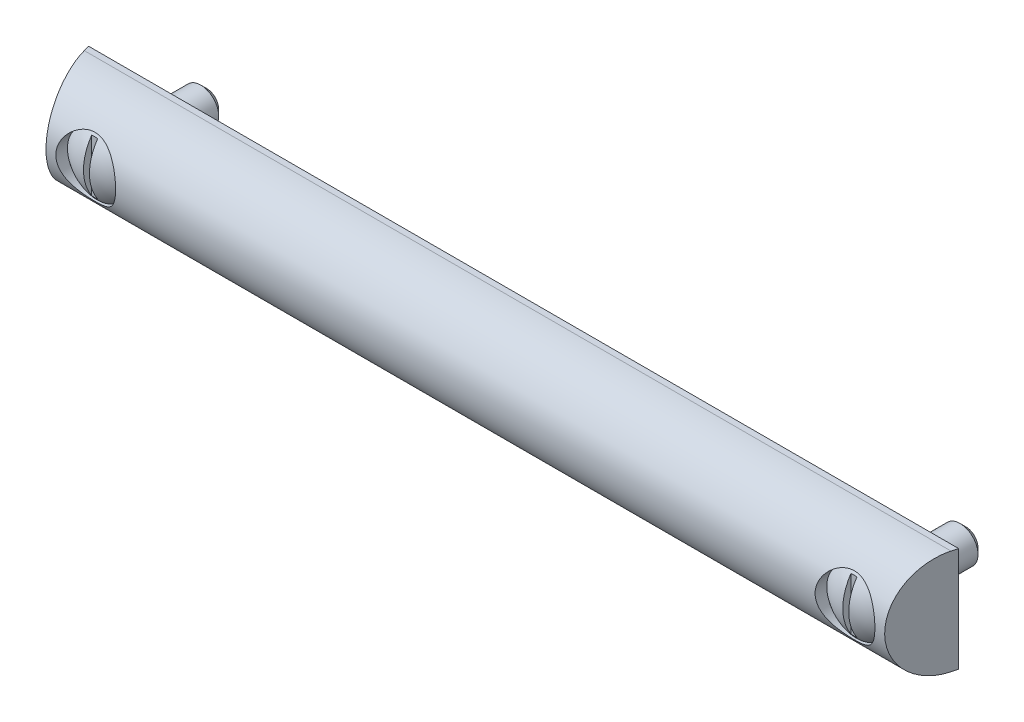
ISO-10303-21;
HEADER;
FILE_DESCRIPTION(('STEP AP214'),'2;1');
FILE_NAME('part.step','',(''),(''),'','','');
FILE_SCHEMA(('AUTOMOTIVE_DESIGN { 1 0 10303 214 1 1 1 1 }'));
ENDSEC;
DATA;
#1=APPLICATION_CONTEXT('core data for automotive mechanical design processes');
#2=APPLICATION_PROTOCOL_DEFINITION('international standard','automotive_design',2000,#1);
#3=PRODUCT_CONTEXT('',#1,'mechanical');
#4=PRODUCT('Part','Part','',(#3));
#5=PRODUCT_RELATED_PRODUCT_CATEGORY('part','',(#4));
#6=PRODUCT_DEFINITION_FORMATION('','',#4);
#7=PRODUCT_DEFINITION_CONTEXT('part definition',#1,'design');
#8=PRODUCT_DEFINITION('design','',#6,#7);
#9=PRODUCT_DEFINITION_SHAPE('','',#8);
#10=(LENGTH_UNIT() NAMED_UNIT(*) SI_UNIT(.MILLI.,.METRE.));
#11=(NAMED_UNIT(*) PLANE_ANGLE_UNIT() SI_UNIT($,.RADIAN.));
#12=(NAMED_UNIT(*) SI_UNIT($,.STERADIAN.) SOLID_ANGLE_UNIT());
#13=UNCERTAINTY_MEASURE_WITH_UNIT(LENGTH_MEASURE(1.E-05),#10,'distance_accuracy_value','');
#14=(GEOMETRIC_REPRESENTATION_CONTEXT(3) GLOBAL_UNCERTAINTY_ASSIGNED_CONTEXT((#13)) GLOBAL_UNIT_ASSIGNED_CONTEXT((#10,
#11,#12)) REPRESENTATION_CONTEXT('',''));
#15=CARTESIAN_POINT('',(0.,0.,0.));
#16=DIRECTION('',(0.,0.,1.));
#17=DIRECTION('',(1.,0.,0.));
#18=AXIS2_PLACEMENT_3D('',#15,#16,#17);
#19=CARTESIAN_POINT('',(254.,-1.11022302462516E-13,3.7525512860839));
#20=DIRECTION('',(0.,0.,-1.));
#21=DIRECTION('',(-1.,0.,0.));
#22=AXIS2_PLACEMENT_3D('',#19,#20,#21);
#23=SPHERICAL_SURFACE('',#22,15.5);
#24=CARTESIAN_POINT('',(254.,0.,15.5952705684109));
#25=DIRECTION('',(0.,0.,-1.));
#26=DIRECTION('',(1.,0.,0.));
#27=AXIS2_PLACEMENT_3D('',#24,#25,#26);
#28=CIRCLE('',#27,10.);
#29=CARTESIAN_POINT('',(264.,0.,15.5952705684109));
#30=VERTEX_POINT('',#29);
#31=EDGE_CURVE('E100',#30,#30,#28,.F.);
#32=ORIENTED_EDGE('',*,*,#31,.T.);
#33=EDGE_LOOP('',(#32));
#34=FACE_BOUND('',#33,.T.);
#35=CARTESIAN_POINT('',(253.,-1.11022302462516E-13,3.7525512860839));
#36=DIRECTION('',(1.,0.,0.));
#37=DIRECTION('',(0.,1.,0.));
#38=AXIS2_PLACEMENT_3D('',#35,#36,#37);
#39=CIRCLE('',#38,15.4677082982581);
#40=CARTESIAN_POINT('',(253.,-8.76085334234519,16.5));
#41=VERTEX_POINT('',#40);
#42=CARTESIAN_POINT('',(253.,8.76085334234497,16.5));
#43=VERTEX_POINT('',#42);
#44=EDGE_CURVE('E87',#41,#43,#39,.F.);
#45=ORIENTED_EDGE('',*,*,#44,.T.);
#46=CARTESIAN_POINT('',(254.,-1.11022302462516E-13,16.5));
#47=DIRECTION('',(0.,0.,1.));
#48=DIRECTION('',(-1.,0.,0.));
#49=AXIS2_PLACEMENT_3D('',#46,#47,#48);
#50=CIRCLE('',#49,8.81774071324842);
#51=CARTESIAN_POINT('',(255.,8.76085334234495,16.5));
#52=VERTEX_POINT('',#51);
#53=EDGE_CURVE('E86',#43,#52,#50,.F.);
#54=ORIENTED_EDGE('',*,*,#53,.T.);
#55=CARTESIAN_POINT('',(255.,-1.11022302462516E-13,3.7525512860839));
#56=DIRECTION('',(-1.,0.,0.));
#57=DIRECTION('',(0.,-1.,0.));
#58=AXIS2_PLACEMENT_3D('',#55,#56,#57);
#59=CIRCLE('',#58,15.467708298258);
#60=CARTESIAN_POINT('',(255.,-8.76085334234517,16.5));
#61=VERTEX_POINT('',#60);
#62=EDGE_CURVE('E79',#52,#61,#59,.F.);
#63=ORIENTED_EDGE('',*,*,#62,.T.);
#64=EDGE_CURVE('E90',#61,#41,#50,.F.);
#65=ORIENTED_EDGE('',*,*,#64,.T.);
#66=EDGE_LOOP('',(#45,#54,#63,#65));
#67=FACE_BOUND('',#66,.T.);
#68=ADVANCED_FACE('F14',(#34,#67),#23,.T.);
#69=CARTESIAN_POINT('',(0.,-1.11022302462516E-13,3.7525512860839));
#70=DIRECTION('',(0.,0.,-1.));
#71=DIRECTION('',(1.,0.,0.));
#72=AXIS2_PLACEMENT_3D('',#69,#70,#71);
#73=SPHERICAL_SURFACE('',#72,15.5);
#74=CARTESIAN_POINT('',(0.,0.,15.5952705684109));
#75=DIRECTION('',(0.,0.,-1.));
#76=DIRECTION('',(1.,0.,0.));
#77=AXIS2_PLACEMENT_3D('',#74,#75,#76);
#78=CIRCLE('',#77,10.);
#79=CARTESIAN_POINT('',(10.,0.,15.5952705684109));
#80=VERTEX_POINT('',#79);
#81=EDGE_CURVE('E114',#80,#80,#78,.F.);
#82=ORIENTED_EDGE('',*,*,#81,.T.);
#83=EDGE_LOOP('',(#82));
#84=FACE_BOUND('',#83,.T.);
#85=CARTESIAN_POINT('',(-1.,-1.11022302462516E-13,3.7525512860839));
#86=DIRECTION('',(-1.,0.,0.));
#87=DIRECTION('',(0.,-1.,0.));
#88=AXIS2_PLACEMENT_3D('',#85,#86,#87);
#89=CIRCLE('',#88,15.467708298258);
#90=CARTESIAN_POINT('',(-1.,8.76085334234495,16.5));
#91=VERTEX_POINT('',#90);
#92=CARTESIAN_POINT('',(-1.,-8.76085334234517,16.5));
#93=VERTEX_POINT('',#92);
#94=EDGE_CURVE('E111',#91,#93,#89,.F.);
#95=ORIENTED_EDGE('',*,*,#94,.F.);
#96=CARTESIAN_POINT('',(0.,-1.11022302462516E-13,16.5));
#97=DIRECTION('',(0.,0.,1.));
#98=DIRECTION('',(-1.,0.,0.));
#99=AXIS2_PLACEMENT_3D('',#96,#97,#98);
#100=CIRCLE('',#99,8.81774071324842);
#101=CARTESIAN_POINT('',(1.,8.76085334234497,16.5));
#102=VERTEX_POINT('',#101);
#103=EDGE_CURVE('E102',#91,#102,#100,.F.);
#104=ORIENTED_EDGE('',*,*,#103,.T.);
#105=CARTESIAN_POINT('',(1.,-1.11022302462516E-13,3.7525512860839));
#106=DIRECTION('',(1.,0.,0.));
#107=DIRECTION('',(0.,1.,0.));
#108=AXIS2_PLACEMENT_3D('',#105,#106,#107);
#109=CIRCLE('',#108,15.4677082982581);
#110=CARTESIAN_POINT('',(1.,-8.76085334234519,16.5));
#111=VERTEX_POINT('',#110);
#112=EDGE_CURVE('E106',#111,#102,#109,.F.);
#113=ORIENTED_EDGE('',*,*,#112,.F.);
#114=EDGE_CURVE('E108',#111,#93,#100,.F.);
#115=ORIENTED_EDGE('',*,*,#114,.T.);
#116=EDGE_LOOP('',(#95,#104,#113,#115));
#117=FACE_BOUND('',#116,.T.);
#118=ADVANCED_FACE('F142',(#84,#117),#73,.T.);
#119=CARTESIAN_POINT('',(-18.5,0.,1.99999999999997));
#120=DIRECTION('',(1.,0.,0.));
#121=DIRECTION('',(0.,1.,0.));
#122=AXIS2_PLACEMENT_3D('',#119,#120,#121);
#123=CYLINDRICAL_SURFACE('',#122,17.5);
#124=DIRECTION('',(1.,0.,0.));
#125=VECTOR('',#124,1.);
#126=CARTESIAN_POINT('',(-18.5,-17.5,1.99999999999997));
#127=LINE('',#126,#125);
#128=CARTESIAN_POINT('',(-17.9641016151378,-17.5,1.99999999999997));
#129=VERTEX_POINT('',#128);
#130=CARTESIAN_POINT('',(271.964101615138,-17.5,1.99999999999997));
#131=VERTEX_POINT('',#130);
#132=EDGE_CURVE('E235',#129,#131,#127,.T.);
#133=ORIENTED_EDGE('',*,*,#132,.T.);
#134=CARTESIAN_POINT('',(271.964101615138,0.,1.99999999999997));
#135=DIRECTION('',(-0.96592582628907,0.,-0.258819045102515));
#136=DIRECTION('',(0.258819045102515,0.,-0.96592582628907));
#137=AXIS2_PLACEMENT_3D('',#134,#135,#136);
#138=ELLIPSE('',#137,18.1173331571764,17.5);
#139=CARTESIAN_POINT('',(271.964101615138,17.5,1.99999999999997));
#140=VERTEX_POINT('',#139);
#141=EDGE_CURVE('E206',#131,#140,#138,.T.);
#142=ORIENTED_EDGE('',*,*,#141,.T.);
#143=DIRECTION('',(1.,0.,0.));
#144=VECTOR('',#143,1.);
#145=CARTESIAN_POINT('',(-18.5,17.5,1.99999999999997));
#146=LINE('',#145,#144);
#147=CARTESIAN_POINT('',(-17.9641016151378,17.5,1.99999999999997));
#148=VERTEX_POINT('',#147);
#149=EDGE_CURVE('E232',#148,#140,#146,.T.);
#150=ORIENTED_EDGE('',*,*,#149,.F.);
#151=CARTESIAN_POINT('',(-17.9641016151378,0.,1.99999999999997));
#152=DIRECTION('',(0.96592582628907,0.,-0.258819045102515));
#153=DIRECTION('',(0.258819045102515,0.,0.96592582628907));
#154=AXIS2_PLACEMENT_3D('',#151,#152,#153);
#155=ELLIPSE('',#154,18.1173331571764,17.5);
#156=EDGE_CURVE('E218',#148,#129,#155,.T.);
#157=ORIENTED_EDGE('',*,*,#156,.T.);
#158=EDGE_LOOP('',(#133,#142,#150,#157));
#159=FACE_BOUND('',#158,.T.);
#160=CARTESIAN_POINT('',(-10.,0.,19.5));
#161=CARTESIAN_POINT('',(-9.9999977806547,-0.257935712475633,19.4999979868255));
#162=CARTESIAN_POINT('',(-9.99000461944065,-0.515951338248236,19.4942823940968));
#163=CARTESIAN_POINT('',(-9.95015233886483,-1.03005660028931,19.4715560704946));
#164=CARTESIAN_POINT('',(-9.92028079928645,-1.28614493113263,19.4545382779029));
#165=CARTESIAN_POINT('',(-9.84097710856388,-1.79487538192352,19.4095881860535));
#166=CARTESIAN_POINT('',(-9.79150280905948,-2.04750885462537,19.3816323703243));
#167=CARTESIAN_POINT('',(-9.67361644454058,-2.54695873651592,19.3154981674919));
#168=CARTESIAN_POINT('',(-9.60520259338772,-2.79377459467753,19.2773188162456));
#169=CARTESIAN_POINT('',(-9.45061368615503,-3.27877572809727,19.1918577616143));
#170=CARTESIAN_POINT('',(-9.36452710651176,-3.51699730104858,19.144621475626));
#171=CARTESIAN_POINT('',(-9.17527162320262,-3.98472670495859,19.0419860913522));
#172=CARTESIAN_POINT('',(-9.07210215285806,-4.2142342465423,18.9865867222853));
#173=CARTESIAN_POINT('',(-8.84967025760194,-4.66326955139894,18.868840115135));
#174=CARTESIAN_POINT('',(-8.73041697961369,-4.88280289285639,18.8064968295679));
#175=CARTESIAN_POINT('',(-8.47664571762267,-5.31116558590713,18.6760808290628));
#176=CARTESIAN_POINT('',(-8.34212249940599,-5.51999123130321,18.6080061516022));
#177=CARTESIAN_POINT('',(-8.04852307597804,-5.94068301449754,18.462421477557));
#178=CARTESIAN_POINT('',(-7.88837724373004,-6.15168976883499,18.3845849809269));
#179=CARTESIAN_POINT('',(-7.55249550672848,-6.55970074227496,18.2255446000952));
#180=CARTESIAN_POINT('',(-7.3767526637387,-6.7566986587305,18.1443392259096));
#181=CARTESIAN_POINT('',(-7.01045324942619,-7.13604426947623,17.9802883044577));
#182=CARTESIAN_POINT('',(-6.81988329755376,-7.31837842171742,17.8974413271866));
#183=CARTESIAN_POINT('',(-6.42487502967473,-7.6674941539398,17.7320326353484));
#184=CARTESIAN_POINT('',(-6.22043628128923,-7.83427524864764,17.6494709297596));
#185=CARTESIAN_POINT('',(-5.77545633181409,-8.16883023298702,17.477703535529));
#186=CARTESIAN_POINT('',(-5.53340750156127,-8.3347366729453,17.3887526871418));
#187=CARTESIAN_POINT('',(-5.03417999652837,-8.64543100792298,17.2163760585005));
#188=CARTESIAN_POINT('',(-4.7769991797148,-8.79021590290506,17.1329510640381));
#189=CARTESIAN_POINT('',(-4.24904620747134,-9.05720701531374,16.9746807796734));
#190=CARTESIAN_POINT('',(-3.97829124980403,-9.1794409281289,16.8998250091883));
#191=CARTESIAN_POINT('',(-3.42444977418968,-9.40010226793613,16.7616074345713));
#192=CARTESIAN_POINT('',(-3.14136733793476,-9.49853750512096,16.6982418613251));
#193=CARTESIAN_POINT('',(-2.62870552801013,-9.65115372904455,16.5983423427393));
#194=CARTESIAN_POINT('',(-2.40114819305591,-9.71030743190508,16.5589737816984));
#195=CARTESIAN_POINT('',(-1.94100710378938,-9.81264540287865,16.4901968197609));
#196=CARTESIAN_POINT('',(-1.70842436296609,-9.85583285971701,16.4607864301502));
#197=CARTESIAN_POINT('',(-1.23987441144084,-9.92566188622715,16.4129467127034));
#198=CARTESIAN_POINT('',(-1.00391039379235,-9.95231813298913,16.3945076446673));
#199=CARTESIAN_POINT('',(-0.530051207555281,-9.98876914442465,16.3692375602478));
#200=CARTESIAN_POINT('',(-0.292156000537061,-9.99856357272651,16.3624067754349));
#201=CARTESIAN_POINT('',(0.184095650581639,-10.001144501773,16.3606097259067));
#202=CARTESIAN_POINT('',(0.42245228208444,-9.99390786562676,16.3656596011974));
#203=CARTESIAN_POINT('',(0.897499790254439,-9.9624877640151,16.387466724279));
#204=CARTESIAN_POINT('',(1.13419066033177,-9.93830423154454,16.404224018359));
#205=CARTESIAN_POINT('',(1.60434735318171,-9.87331886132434,16.4488449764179));
#206=CARTESIAN_POINT('',(1.83781121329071,-9.83250733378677,16.4767151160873));
#207=CARTESIAN_POINT('',(2.29987542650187,-9.73480084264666,16.5425965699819));
#208=CARTESIAN_POINT('',(2.52847566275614,-9.67790549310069,16.5806081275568));
#209=CARTESIAN_POINT('',(2.97861423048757,-9.54894973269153,16.6653837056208));
#210=CARTESIAN_POINT('',(3.20017809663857,-9.47695373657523,16.712110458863));
#211=CARTESIAN_POINT('',(3.63627918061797,-9.31833428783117,16.8130846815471));
#212=CARTESIAN_POINT('',(3.85081395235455,-9.23170580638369,16.8673347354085));
#213=CARTESIAN_POINT('',(4.48253403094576,-8.95093131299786,17.0392492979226));
#214=CARTESIAN_POINT('',(4.88806063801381,-8.73583079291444,17.1661231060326));
#215=CARTESIAN_POINT('',(5.72497704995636,-8.21612488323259,17.4546711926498));
#216=CARTESIAN_POINT('',(6.15009733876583,-7.90270010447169,17.6186641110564));
#217=CARTESIAN_POINT('',(6.74648411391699,-7.38608766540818,17.8660772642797));
#218=CARTESIAN_POINT('',(6.93852490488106,-7.20598629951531,17.9488477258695));
#219=CARTESIAN_POINT('',(7.30815820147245,-6.83082318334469,18.1130920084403));
#220=CARTESIAN_POINT('',(7.48574836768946,-6.63575902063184,18.1945656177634));
#221=CARTESIAN_POINT('',(7.84495384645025,-6.20832453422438,18.3635383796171));
#222=CARTESIAN_POINT('',(8.02470889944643,-5.97423857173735,18.4506617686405));
#223=CARTESIAN_POINT('',(8.363675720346,-5.4896547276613,18.6186465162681));
#224=CARTESIAN_POINT('',(8.5228957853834,-5.23916353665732,18.6995103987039));
#225=CARTESIAN_POINT('',(8.81935846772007,-4.72307604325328,18.8527441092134));
#226=CARTESIAN_POINT('',(8.95660579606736,-4.45748299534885,18.9251157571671));
#227=CARTESIAN_POINT('',(9.2075809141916,-3.91284084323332,19.0592582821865));
#228=CARTESIAN_POINT('',(9.32131162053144,-3.63379341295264,19.121030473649));
#229=CARTESIAN_POINT('',(9.5167243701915,-3.08400643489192,19.2282281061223));
#230=CARTESIAN_POINT('',(9.60007710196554,-2.81402367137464,19.2744877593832));
#231=CARTESIAN_POINT('',(9.74393492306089,-2.26625179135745,19.3548466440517));
#232=CARTESIAN_POINT('',(9.80444084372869,-1.98846295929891,19.3889463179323));
#233=CARTESIAN_POINT('',(9.90164701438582,-1.42769004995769,19.4439389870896));
#234=CARTESIAN_POINT('',(9.93836681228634,-1.14471043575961,19.4648428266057));
#235=CARTESIAN_POINT('',(9.98747639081,-0.575979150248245,19.4928348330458));
#236=CARTESIAN_POINT('',(9.99986889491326,-0.290227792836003,19.499924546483));
#237=CARTESIAN_POINT('',(10.0001132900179,0.246547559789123,19.5000652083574));
#238=CARTESIAN_POINT('',(9.99076218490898,0.497575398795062,19.4947162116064));
#239=CARTESIAN_POINT('',(9.95325995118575,0.997744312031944,19.4733266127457));
#240=CARTESIAN_POINT('',(9.92511066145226,1.24688556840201,19.4572870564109));
#241=CARTESIAN_POINT('',(9.85037029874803,1.7414840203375,19.4149031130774));
#242=CARTESIAN_POINT('',(9.80377933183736,1.98694123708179,19.3885587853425));
#243=CARTESIAN_POINT('',(9.6927137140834,2.4725160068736,19.3261821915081));
#244=CARTESIAN_POINT('',(9.62823852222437,2.71263339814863,19.2901496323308));
#245=CARTESIAN_POINT('',(9.4828892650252,3.18353496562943,19.2096359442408));
#246=CARTESIAN_POINT('',(9.4021953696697,3.41439087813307,19.1652479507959));
#247=CARTESIAN_POINT('',(9.22475082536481,3.86825118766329,19.0686990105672));
#248=CARTESIAN_POINT('',(9.12799449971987,4.09125277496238,19.0165353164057));
#249=CARTESIAN_POINT('',(8.91929412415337,4.52822362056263,18.9055021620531));
#250=CARTESIAN_POINT('',(8.80735321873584,4.74219473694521,18.8466340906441));
#251=CARTESIAN_POINT('',(8.56905560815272,5.16035121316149,18.7232867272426));
#252=CARTESIAN_POINT('',(8.44269370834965,5.36453300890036,18.6588054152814));
#253=CARTESIAN_POINT('',(8.1625583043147,5.78294300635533,18.5185098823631));
#254=CARTESIAN_POINT('',(8.00730106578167,5.99601710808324,18.4422138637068));
#255=CARTESIAN_POINT('',(7.68114943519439,6.40851919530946,18.2858700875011));
#256=CARTESIAN_POINT('',(7.51024796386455,6.60794093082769,18.2058206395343));
#257=CARTESIAN_POINT('',(7.1536027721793,6.99248118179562,18.0436525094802));
#258=CARTESIAN_POINT('',(6.96784630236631,7.17758713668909,17.961532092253));
#259=CARTESIAN_POINT('',(6.58242896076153,7.53261477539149,17.797088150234));
#260=CARTESIAN_POINT('',(6.38276753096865,7.70253584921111,17.7147646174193));
#261=CARTESIAN_POINT('',(5.94723697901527,8.0445859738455,17.542691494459));
#262=CARTESIAN_POINT('',(5.7098143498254,8.21484268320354,17.4531392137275));
#263=CARTESIAN_POINT('',(5.21968646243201,8.5346651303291,17.2788309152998));
#264=CARTESIAN_POINT('',(4.96697902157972,8.68422790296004,17.1940755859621));
#265=CARTESIAN_POINT('',(4.44770976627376,8.96127110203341,17.032342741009));
#266=CARTESIAN_POINT('',(4.1811631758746,9.08877515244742,16.955356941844));
#267=CARTESIAN_POINT('',(3.63540239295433,9.32049704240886,16.8120530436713));
#268=CARTESIAN_POINT('',(3.35619212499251,9.42472203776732,16.7457316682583));
#269=CARTESIAN_POINT('',(2.84770214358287,9.58884562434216,16.6393800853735));
#270=CARTESIAN_POINT('',(2.6204762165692,9.65345712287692,16.5967594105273));
#271=CARTESIAN_POINT('',(2.16050662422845,9.76669228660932,16.5212384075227));
#272=CARTESIAN_POINT('',(1.92776407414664,9.81531915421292,16.4883361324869));
#273=CARTESIAN_POINT('',(1.45836856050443,9.89594934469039,16.4333839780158));
#274=CARTESIAN_POINT('',(1.22171948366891,9.92796827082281,16.4113239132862));
#275=CARTESIAN_POINT('',(0.745930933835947,9.97500517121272,16.3788071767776));
#276=CARTESIAN_POINT('',(0.506791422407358,9.9900228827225,16.3683506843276));
#277=CARTESIAN_POINT('',(0.0273396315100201,10.002843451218,16.3594284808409));
#278=CARTESIAN_POINT('',(-0.212974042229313,10.0006113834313,16.3609870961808));
#279=CARTESIAN_POINT('',(-0.692436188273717,9.97888391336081,16.3760929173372));
#280=CARTESIAN_POINT('',(-0.931584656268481,9.95938844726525,16.3896401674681));
#281=CARTESIAN_POINT('',(-1.40706647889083,9.90340870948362,16.4282238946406));
#282=CARTESIAN_POINT('',(-1.64339824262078,9.86691526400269,16.4532665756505));
#283=CARTESIAN_POINT('',(-2.11151936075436,9.77743745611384,16.5139460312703));
#284=CARTESIAN_POINT('',(-2.34330863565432,9.72445280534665,16.5495829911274));
#285=CARTESIAN_POINT('',(-2.79695533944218,9.60370550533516,16.6295585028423));
#286=CARTESIAN_POINT('',(-3.01891582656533,9.53621989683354,16.6737325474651));
#287=CARTESIAN_POINT('',(-3.45614729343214,9.38661175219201,16.7698820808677));
#288=CARTESIAN_POINT('',(-3.67141595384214,9.30448420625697,16.8218602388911));
#289=CARTESIAN_POINT('',(-4.30577882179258,9.03718626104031,16.9874360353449));
#290=CARTESIAN_POINT('',(-4.7136655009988,8.831036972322,17.110718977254));
#291=CARTESIAN_POINT('',(-5.55432832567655,8.33209861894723,17.3922047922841));
#292=CARTESIAN_POINT('',(-5.98126541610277,8.03085638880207,17.5528615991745));
#293=CARTESIAN_POINT('',(-6.58192443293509,7.53299810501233,17.7967817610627));
#294=CARTESIAN_POINT('',(-6.7756487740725,7.35923330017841,17.8786395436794));
#295=CARTESIAN_POINT('',(-7.14920908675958,6.99689199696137,18.0415995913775));
#296=CARTESIAN_POINT('',(-7.32904286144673,6.80831316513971,18.1227017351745));
#297=CARTESIAN_POINT('',(-7.69546640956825,6.39264072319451,18.2923489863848));
#298=CARTESIAN_POINT('',(-7.88009583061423,6.16367817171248,18.3805589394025));
#299=CARTESIAN_POINT('',(-8.22928186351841,5.68908312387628,18.5513716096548));
#300=CARTESIAN_POINT('',(-8.39384573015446,5.44345670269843,18.6339763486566));
#301=CARTESIAN_POINT('',(-8.70151782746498,4.936742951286,18.7913352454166));
#302=CARTESIAN_POINT('',(-8.84462815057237,4.67565713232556,18.8660901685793));
#303=CARTESIAN_POINT('',(-9.10783647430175,4.13961449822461,19.0055939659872));
#304=CARTESIAN_POINT('',(-9.22794081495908,3.8646615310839,19.0703455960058));
#305=CARTESIAN_POINT('',(-9.42442766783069,3.35281738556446,19.1774365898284));
#306=CARTESIAN_POINT('',(-9.50478707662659,3.11785055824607,19.2217138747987));
#307=CARTESIAN_POINT('',(-9.64810884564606,2.64119257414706,19.3012266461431));
#308=CARTESIAN_POINT('',(-9.71107428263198,2.39950261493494,19.3364637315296));
#309=CARTESIAN_POINT('',(-9.81877892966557,1.91151047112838,19.397023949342));
#310=CARTESIAN_POINT('',(-9.86356263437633,1.66522110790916,19.4223712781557));
#311=CARTESIAN_POINT('',(-9.93456493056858,1.16923562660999,19.4626664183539));
#312=CARTESIAN_POINT('',(-9.96079408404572,0.919541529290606,19.4776201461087));
#313=CARTESIAN_POINT('',(-9.9850556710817,0.557783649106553,19.4914638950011));
#314=CARTESIAN_POINT('',(-9.9906574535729,0.446336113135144,19.4946628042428));
#315=CARTESIAN_POINT('',(-9.99813029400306,0.223264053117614,19.498931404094));
#316=CARTESIAN_POINT('',(-10.0000009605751,0.111639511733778,19.5000008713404));
#317=CARTESIAN_POINT('',(-10.,0.,19.5));
#318=B_SPLINE_CURVE_WITH_KNOTS('',3,(#160,#161,#162,#163,#164,#165,#166,#167,#168,#169,#170,
#171,#172,#173,#174,#175,#176,#177,#178,#179,#180,#181,#182,#183,#184,#185,#186,#187,#188,#189,
#190,#191,#192,#193,#194,#195,#196,#197,#198,#199,#200,#201,#202,#203,#204,#205,#206,#207,#208,
#209,#210,#211,#212,#213,#214,#215,#216,#217,#218,#219,#220,#221,#222,#223,#224,#225,#226,#227,
#228,#229,#230,#231,#232,#233,#234,#235,#236,#237,#238,#239,#240,#241,#242,#243,#244,#245,#246,
#247,#248,#249,#250,#251,#252,#253,#254,#255,#256,#257,#258,#259,#260,#261,#262,#263,#264,#265,
#266,#267,#268,#269,#270,#271,#272,#273,#274,#275,#276,#277,#278,#279,#280,#281,#282,#283,#284,
#285,#286,#287,#288,#289,#290,#291,#292,#293,#294,#295,#296,#297,#298,#299,#300,#301,#302,#303,
#304,#305,#306,#307,#308,#309,#310,#311,#312,#313,#314,#315,#316,#317),.UNSPECIFIED.,.T.,.F.,(4,
2,2,2,2,2,2,2,2,2,2,2,2,2,2,2,2,2,2,2,2,2,2,2,2,2,2,2,2,2,2,2,2,2,2,2,2,2,2,2,2,2,2,2,2,2,2,2,2,
2,2,2,2,2,2,2,2,2,2,2,2,2,2,2,2,2,2,2,2,2,2,2,2,2,2,2,2,2,4),(0.,0.77369081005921,
1.54786548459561,2.32371384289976,3.09963539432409,3.87176318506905,4.64391659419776,
5.41563271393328,6.18761416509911,7.01505666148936,7.84286910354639,8.67143745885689,
9.50003165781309,10.4188051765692,11.3377090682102,12.2554768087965,13.1729429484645,
13.8873907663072,14.6016958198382,15.3153657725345,16.0290499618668,16.7437042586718,
17.4583613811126,18.1734355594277,18.888526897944,19.6006277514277,20.3129738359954,
21.736955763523,23.3891327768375,24.2164532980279,25.0439074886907,25.9659444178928,
26.8876076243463,27.8090729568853,28.7304239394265,29.5881564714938,30.4458577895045,
31.3028533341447,32.1597529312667,32.9126084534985,33.6653903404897,34.4181678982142,
35.1709682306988,35.9158271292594,36.6609498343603,37.405918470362,38.151156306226,
38.9736800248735,39.7965778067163,40.6201895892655,41.4438344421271,42.3594547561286,
43.2752061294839,44.1899706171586,45.1044535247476,45.8238669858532,46.5431362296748,
47.2617284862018,47.9803318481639,48.7003905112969,49.420451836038,50.140902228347,
50.8613652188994,51.5691248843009,52.2771271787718,53.6923953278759,55.3255949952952,
56.1434108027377,56.9613556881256,57.8814354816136,58.8011816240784,59.7208380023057,
60.640240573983,61.3961780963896,62.1519818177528,62.9059246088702,63.6594378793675,
63.9942709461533,64.3291391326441),.UNSPECIFIED.);
#319=CARTESIAN_POINT('',(-10.,0.,19.5));
#320=VERTEX_POINT('',#319);
#321=EDGE_CURVE('E125',#320,#320,#318,.T.);
#322=ORIENTED_EDGE('',*,*,#321,.F.);
#323=EDGE_LOOP('',(#322));
#324=FACE_BOUND('',#323,.T.);
#325=CARTESIAN_POINT('',(244.,0.,19.5));
#326=CARTESIAN_POINT('',(244.000002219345,-0.25793571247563,19.4999979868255));
#327=CARTESIAN_POINT('',(244.009995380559,-0.515951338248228,19.4942823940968));
#328=CARTESIAN_POINT('',(244.049847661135,-1.03005660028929,19.4715560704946));
#329=CARTESIAN_POINT('',(244.079719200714,-1.28614493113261,19.4545382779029));
#330=CARTESIAN_POINT('',(244.159022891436,-1.7948753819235,19.4095881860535));
#331=CARTESIAN_POINT('',(244.208497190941,-2.04750885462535,19.3816323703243));
#332=CARTESIAN_POINT('',(244.326383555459,-2.5469587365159,19.3154981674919));
#333=CARTESIAN_POINT('',(244.394797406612,-2.79377459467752,19.2773188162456));
#334=CARTESIAN_POINT('',(244.549386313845,-3.27877572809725,19.1918577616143));
#335=CARTESIAN_POINT('',(244.635472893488,-3.51699730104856,19.144621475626));
#336=CARTESIAN_POINT('',(244.824728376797,-3.98472670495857,19.0419860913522));
#337=CARTESIAN_POINT('',(244.927897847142,-4.21423424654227,18.9865867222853));
#338=CARTESIAN_POINT('',(245.150329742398,-4.66326955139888,18.868840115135));
#339=CARTESIAN_POINT('',(245.269583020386,-4.88280289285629,18.8064968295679));
#340=CARTESIAN_POINT('',(245.523354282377,-5.31116558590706,18.6760808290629));
#341=CARTESIAN_POINT('',(245.657877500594,-5.5199912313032,18.6080061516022));
#342=CARTESIAN_POINT('',(245.951476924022,-5.94068301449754,18.4624214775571));
#343=CARTESIAN_POINT('',(246.11162275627,-6.15168976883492,18.3845849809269));
#344=CARTESIAN_POINT('',(246.447504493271,-6.55970074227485,18.2255446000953));
#345=CARTESIAN_POINT('',(246.623247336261,-6.75669865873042,18.1443392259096));
#346=CARTESIAN_POINT('',(246.989546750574,-7.1360442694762,17.9802883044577));
#347=CARTESIAN_POINT('',(247.180116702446,-7.31837842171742,17.8974413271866));
#348=CARTESIAN_POINT('',(247.575124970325,-7.6674941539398,17.7320326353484));
#349=CARTESIAN_POINT('',(247.779563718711,-7.83427524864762,17.6494709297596));
#350=CARTESIAN_POINT('',(248.224543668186,-8.168830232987,17.477703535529));
#351=CARTESIAN_POINT('',(248.466592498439,-8.3347366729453,17.3887526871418));
#352=CARTESIAN_POINT('',(248.965820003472,-8.645431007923,17.2163760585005));
#353=CARTESIAN_POINT('',(249.223000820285,-8.79021590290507,17.1329510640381));
#354=CARTESIAN_POINT('',(249.750953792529,-9.05720701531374,16.9746807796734));
#355=CARTESIAN_POINT('',(250.021708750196,-9.17944092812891,16.8998250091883));
#356=CARTESIAN_POINT('',(250.57555022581,-9.40010226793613,16.7616074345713));
#357=CARTESIAN_POINT('',(250.858632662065,-9.49853750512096,16.6982418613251));
#358=CARTESIAN_POINT('',(251.37129447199,-9.65115372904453,16.5983423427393));
#359=CARTESIAN_POINT('',(251.598851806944,-9.71030743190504,16.5589737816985));
#360=CARTESIAN_POINT('',(252.05899289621,-9.81264540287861,16.4901968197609));
#361=CARTESIAN_POINT('',(252.291575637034,-9.85583285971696,16.4607864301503));
#362=CARTESIAN_POINT('',(252.760125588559,-9.92566188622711,16.4129467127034));
#363=CARTESIAN_POINT('',(252.996089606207,-9.9523181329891,16.3945076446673));
#364=CARTESIAN_POINT('',(253.469948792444,-9.98876914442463,16.3692375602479));
#365=CARTESIAN_POINT('',(253.707843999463,-9.9985635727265,16.3624067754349));
#366=CARTESIAN_POINT('',(254.184095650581,-10.001144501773,16.3606097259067));
#367=CARTESIAN_POINT('',(254.422452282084,-9.99390786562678,16.3656596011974));
#368=CARTESIAN_POINT('',(254.897499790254,-9.96248776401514,16.387466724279));
#369=CARTESIAN_POINT('',(255.134190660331,-9.93830423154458,16.404224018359));
#370=CARTESIAN_POINT('',(255.604347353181,-9.87331886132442,16.4488449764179));
#371=CARTESIAN_POINT('',(255.83781121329,-9.83250733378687,16.4767151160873));
#372=CARTESIAN_POINT('',(256.299875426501,-9.73480084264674,16.5425965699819));
#373=CARTESIAN_POINT('',(256.528475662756,-9.6779054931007,16.5806081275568));
#374=CARTESIAN_POINT('',(256.978614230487,-9.54894973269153,16.6653837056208));
#375=CARTESIAN_POINT('',(257.200178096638,-9.47695373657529,16.712110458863));
#376=CARTESIAN_POINT('',(257.636279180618,-9.31833428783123,16.8130846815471));
#377=CARTESIAN_POINT('',(257.850813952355,-9.23170580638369,16.8673347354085));
#378=CARTESIAN_POINT('',(258.482534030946,-8.9509313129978,17.0392492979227));
#379=CARTESIAN_POINT('',(258.888060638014,-8.73583079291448,17.1661231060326));
#380=CARTESIAN_POINT('',(259.724977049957,-8.21612488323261,17.4546711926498));
#381=CARTESIAN_POINT('',(260.150097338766,-7.90270010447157,17.6186641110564));
#382=CARTESIAN_POINT('',(260.746484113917,-7.386087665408,17.8660772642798));
#383=CARTESIAN_POINT('',(260.938524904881,-7.20598629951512,17.9488477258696));
#384=CARTESIAN_POINT('',(261.308158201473,-6.83082318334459,18.1130920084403));
#385=CARTESIAN_POINT('',(261.48574836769,-6.63575902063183,18.1945656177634));
#386=CARTESIAN_POINT('',(261.84495384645,-6.2083245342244,18.3635383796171));
#387=CARTESIAN_POINT('',(262.024708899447,-5.97423857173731,18.4506617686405));
#388=CARTESIAN_POINT('',(262.363675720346,-5.4896547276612,18.6186465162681));
#389=CARTESIAN_POINT('',(262.522895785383,-5.23916353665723,18.6995103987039));
#390=CARTESIAN_POINT('',(262.81935846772,-4.72307604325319,18.8527441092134));
#391=CARTESIAN_POINT('',(262.956605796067,-4.45748299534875,18.9251157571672));
#392=CARTESIAN_POINT('',(263.207580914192,-3.91284084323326,19.0592582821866));
#393=CARTESIAN_POINT('',(263.321311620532,-3.63379341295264,19.121030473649));
#394=CARTESIAN_POINT('',(263.516724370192,-3.08400643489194,19.2282281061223));
#395=CARTESIAN_POINT('',(263.600077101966,-2.81402367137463,19.2744877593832));
#396=CARTESIAN_POINT('',(263.743934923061,-2.26625179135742,19.3548466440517));
#397=CARTESIAN_POINT('',(263.804440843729,-1.9884629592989,19.3889463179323));
#398=CARTESIAN_POINT('',(263.901647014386,-1.42769004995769,19.4439389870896));
#399=CARTESIAN_POINT('',(263.938366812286,-1.14471043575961,19.4648428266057));
#400=CARTESIAN_POINT('',(263.98747639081,-0.575979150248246,19.4928348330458));
#401=CARTESIAN_POINT('',(263.999868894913,-0.290227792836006,19.4999245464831));
#402=CARTESIAN_POINT('',(264.000113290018,0.246547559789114,19.5000652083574));
#403=CARTESIAN_POINT('',(263.990762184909,0.49757539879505,19.4947162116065));
#404=CARTESIAN_POINT('',(263.953259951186,0.997744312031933,19.4733266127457));
#405=CARTESIAN_POINT('',(263.925110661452,1.24688556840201,19.4572870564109));
#406=CARTESIAN_POINT('',(263.850370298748,1.74148402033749,19.4149031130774));
#407=CARTESIAN_POINT('',(263.803779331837,1.98694123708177,19.3885587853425));
#408=CARTESIAN_POINT('',(263.692713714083,2.47251600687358,19.3261821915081));
#409=CARTESIAN_POINT('',(263.628238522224,2.71263339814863,19.2901496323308));
#410=CARTESIAN_POINT('',(263.482889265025,3.18353496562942,19.2096359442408));
#411=CARTESIAN_POINT('',(263.40219536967,3.41439087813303,19.1652479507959));
#412=CARTESIAN_POINT('',(263.224750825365,3.86825118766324,19.0686990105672));
#413=CARTESIAN_POINT('',(263.12799449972,4.09125277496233,19.0165353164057));
#414=CARTESIAN_POINT('',(262.919294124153,4.52822362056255,18.9055021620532));
#415=CARTESIAN_POINT('',(262.807353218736,4.7421947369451,18.8466340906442));
#416=CARTESIAN_POINT('',(262.569055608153,5.16035121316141,18.7232867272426));
#417=CARTESIAN_POINT('',(262.44269370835,5.36453300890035,18.6588054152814));
#418=CARTESIAN_POINT('',(262.162558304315,5.78294300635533,18.5185098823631));
#419=CARTESIAN_POINT('',(262.007301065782,5.99601710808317,18.4422138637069));
#420=CARTESIAN_POINT('',(261.681149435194,6.40851919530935,18.2858700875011));
#421=CARTESIAN_POINT('',(261.510247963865,6.60794093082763,18.2058206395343));
#422=CARTESIAN_POINT('',(261.153602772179,6.9924811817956,18.0436525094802));
#423=CARTESIAN_POINT('',(260.967846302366,7.17758713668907,17.961532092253));
#424=CARTESIAN_POINT('',(260.582428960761,7.53261477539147,17.797088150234));
#425=CARTESIAN_POINT('',(260.382767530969,7.70253584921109,17.7147646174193));
#426=CARTESIAN_POINT('',(259.947236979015,8.04458597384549,17.542691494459));
#427=CARTESIAN_POINT('',(259.709814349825,8.21484268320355,17.4531392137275));
#428=CARTESIAN_POINT('',(259.219686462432,8.53466513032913,17.2788309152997));
#429=CARTESIAN_POINT('',(258.96697902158,8.68422790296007,17.1940755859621));
#430=CARTESIAN_POINT('',(258.447709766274,8.96127110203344,17.032342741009));
#431=CARTESIAN_POINT('',(258.181163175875,9.08877515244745,16.955356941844));
#432=CARTESIAN_POINT('',(257.635402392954,9.32049704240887,16.8120530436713));
#433=CARTESIAN_POINT('',(257.356192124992,9.42472203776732,16.7457316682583));
#434=CARTESIAN_POINT('',(256.847702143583,9.58884562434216,16.6393800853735));
#435=CARTESIAN_POINT('',(256.620476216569,9.65345712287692,16.5967594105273));
#436=CARTESIAN_POINT('',(256.160506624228,9.76669228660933,16.5212384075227));
#437=CARTESIAN_POINT('',(255.927764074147,9.81531915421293,16.4883361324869));
#438=CARTESIAN_POINT('',(255.458368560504,9.8959493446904,16.4333839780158));
#439=CARTESIAN_POINT('',(255.221719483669,9.92796827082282,16.4113239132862));
#440=CARTESIAN_POINT('',(254.745930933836,9.97500517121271,16.3788071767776));
#441=CARTESIAN_POINT('',(254.506791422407,9.9900228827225,16.3683506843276));
#442=CARTESIAN_POINT('',(254.02733963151,10.002843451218,16.3594284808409));
#443=CARTESIAN_POINT('',(253.787025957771,10.0006113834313,16.3609870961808));
#444=CARTESIAN_POINT('',(253.307563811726,9.97888391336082,16.3760929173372));
#445=CARTESIAN_POINT('',(253.068415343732,9.95938844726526,16.3896401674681));
#446=CARTESIAN_POINT('',(252.592933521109,9.90340870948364,16.4282238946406));
#447=CARTESIAN_POINT('',(252.356601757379,9.86691526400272,16.4532665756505));
#448=CARTESIAN_POINT('',(251.888480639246,9.77743745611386,16.5139460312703));
#449=CARTESIAN_POINT('',(251.656691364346,9.72445280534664,16.5495829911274));
#450=CARTESIAN_POINT('',(251.203044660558,9.60370550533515,16.6295585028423));
#451=CARTESIAN_POINT('',(250.981084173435,9.53621989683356,16.6737325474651));
#452=CARTESIAN_POINT('',(250.543852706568,9.38661175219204,16.7698820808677));
#453=CARTESIAN_POINT('',(250.328584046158,9.30448420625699,16.8218602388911));
#454=CARTESIAN_POINT('',(249.694221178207,9.03718626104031,16.9874360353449));
#455=CARTESIAN_POINT('',(249.286334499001,8.83103697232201,17.1107189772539));
#456=CARTESIAN_POINT('',(248.445671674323,8.33209861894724,17.3922047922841));
#457=CARTESIAN_POINT('',(248.018734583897,8.03085638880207,17.5528615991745));
#458=CARTESIAN_POINT('',(247.418075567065,7.53299810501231,17.7967817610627));
#459=CARTESIAN_POINT('',(247.224351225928,7.35923330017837,17.8786395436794));
#460=CARTESIAN_POINT('',(246.85079091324,6.99689199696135,18.0415995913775));
#461=CARTESIAN_POINT('',(246.670957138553,6.80831316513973,18.1227017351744));
#462=CARTESIAN_POINT('',(246.304533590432,6.39264072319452,18.2923489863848));
#463=CARTESIAN_POINT('',(246.119904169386,6.16367817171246,18.3805589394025));
#464=CARTESIAN_POINT('',(245.770718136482,5.68908312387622,18.5513716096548));
#465=CARTESIAN_POINT('',(245.606154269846,5.44345670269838,18.6339763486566));
#466=CARTESIAN_POINT('',(245.298482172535,4.93674295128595,18.7913352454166));
#467=CARTESIAN_POINT('',(245.155371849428,4.6756571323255,18.8660901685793));
#468=CARTESIAN_POINT('',(244.892163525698,4.13961449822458,19.0055939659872));
#469=CARTESIAN_POINT('',(244.772059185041,3.8646615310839,19.0703455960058));
#470=CARTESIAN_POINT('',(244.575572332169,3.35281738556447,19.1774365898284));
#471=CARTESIAN_POINT('',(244.495212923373,3.11785055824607,19.2217138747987));
#472=CARTESIAN_POINT('',(244.351891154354,2.64119257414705,19.3012266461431));
#473=CARTESIAN_POINT('',(244.288925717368,2.39950261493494,19.3364637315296));
#474=CARTESIAN_POINT('',(244.181221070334,1.9115104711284,19.397023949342));
#475=CARTESIAN_POINT('',(244.136437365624,1.66522110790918,19.4223712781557));
#476=CARTESIAN_POINT('',(244.065435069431,1.16923562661,19.4626664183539));
#477=CARTESIAN_POINT('',(244.039205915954,0.919541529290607,19.4776201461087));
#478=CARTESIAN_POINT('',(244.014944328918,0.557783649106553,19.4914638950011));
#479=CARTESIAN_POINT('',(244.009342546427,0.446336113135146,19.4946628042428));
#480=CARTESIAN_POINT('',(244.001869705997,0.223264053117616,19.498931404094));
#481=CARTESIAN_POINT('',(243.999999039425,0.111639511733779,19.5000008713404));
#482=CARTESIAN_POINT('',(244.,0.,19.5));
#483=B_SPLINE_CURVE_WITH_KNOTS('',3,(#325,#326,#327,#328,#329,#330,#331,#332,#333,#334,#335,
#336,#337,#338,#339,#340,#341,#342,#343,#344,#345,#346,#347,#348,#349,#350,#351,#352,#353,#354,
#355,#356,#357,#358,#359,#360,#361,#362,#363,#364,#365,#366,#367,#368,#369,#370,#371,#372,#373,
#374,#375,#376,#377,#378,#379,#380,#381,#382,#383,#384,#385,#386,#387,#388,#389,#390,#391,#392,
#393,#394,#395,#396,#397,#398,#399,#400,#401,#402,#403,#404,#405,#406,#407,#408,#409,#410,#411,
#412,#413,#414,#415,#416,#417,#418,#419,#420,#421,#422,#423,#424,#425,#426,#427,#428,#429,#430,
#431,#432,#433,#434,#435,#436,#437,#438,#439,#440,#441,#442,#443,#444,#445,#446,#447,#448,#449,
#450,#451,#452,#453,#454,#455,#456,#457,#458,#459,#460,#461,#462,#463,#464,#465,#466,#467,#468,
#469,#470,#471,#472,#473,#474,#475,#476,#477,#478,#479,#480,#481,#482),.UNSPECIFIED.,.T.,.F.,(4,
2,2,2,2,2,2,2,2,2,2,2,2,2,2,2,2,2,2,2,2,2,2,2,2,2,2,2,2,2,2,2,2,2,2,2,2,2,2,2,2,2,2,2,2,2,2,2,2,
2,2,2,2,2,2,2,2,2,2,2,2,2,2,2,2,2,2,2,2,2,2,2,2,2,2,2,2,2,4),(0.,0.773690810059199,
1.54786548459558,2.32371384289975,3.09963539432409,3.87176318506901,4.64391659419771,
5.41563271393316,6.18761416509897,7.01505666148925,7.84286910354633,8.67143745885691,
9.50003165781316,10.4188051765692,11.3377090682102,12.2554768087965,13.1729429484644,
13.887390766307,14.6016958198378,15.3153657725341,16.0290499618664,16.7437042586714,
17.4583613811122,18.1734355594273,18.8885268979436,19.6006277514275,20.3129738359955,
21.7369557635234,23.3891327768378,24.2164532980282,25.0439074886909,25.9659444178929,
26.8876076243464,27.8090729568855,28.7304239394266,29.5881564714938,30.4458577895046,
31.3028533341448,32.1597529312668,32.9126084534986,33.6653903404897,34.4181678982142,
35.1709682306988,35.9158271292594,36.6609498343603,37.405918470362,38.151156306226,
38.9736800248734,39.7965778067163,40.6201895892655,41.4438344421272,42.3594547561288,
43.275206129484,44.1899706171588,45.1044535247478,45.8238669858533,46.5431362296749,
47.2617284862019,47.980331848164,48.700390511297,49.420451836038,50.1409022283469,
50.8613652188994,51.5691248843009,52.2771271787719,53.692395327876,55.3255949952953,
56.1434108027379,56.9613556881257,57.8814354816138,58.8011816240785,59.7208380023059,
60.6402405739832,61.3961780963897,62.1519818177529,62.9059246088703,63.6594378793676,
63.9942709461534,64.3291391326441),.UNSPECIFIED.);
#484=CARTESIAN_POINT('',(244.,0.,19.5));
#485=VERTEX_POINT('',#484);
#486=EDGE_CURVE('E117',#485,#485,#483,.T.);
#487=ORIENTED_EDGE('',*,*,#486,.F.);
#488=EDGE_LOOP('',(#487));
#489=FACE_BOUND('',#488,.T.);
#490=ADVANCED_FACE('F131',(#159,#324,#489),#123,.T.);
#491=CARTESIAN_POINT('',(-18.5,-17.5,0.));
#492=DIRECTION('',(0.,0.,1.));
#493=DIRECTION('',(-1.,0.,0.));
#494=AXIS2_PLACEMENT_3D('',#491,#492,#493);
#495=PLANE('',#494);
#496=CARTESIAN_POINT('',(0.,0.,0.));
#497=DIRECTION('',(0.,0.,1.));
#498=DIRECTION('',(-1.,0.,0.));
#499=AXIS2_PLACEMENT_3D('',#496,#497,#498);
#500=CIRCLE('',#499,6.);
#501=CARTESIAN_POINT('',(-6.,0.,0.));
#502=VERTEX_POINT('',#501);
#503=EDGE_CURVE('E244',#502,#502,#500,.F.);
#504=ORIENTED_EDGE('',*,*,#503,.F.);
#505=EDGE_LOOP('',(#504));
#506=FACE_BOUND('',#505,.T.);
#507=DIRECTION('',(0.,-1.,0.));
#508=VECTOR('',#507,1.);
#509=CARTESIAN_POINT('',(272.5,-17.5,0.));
#510=LINE('',#509,#508);
#511=CARTESIAN_POINT('',(272.5,17.5,0.));
#512=VERTEX_POINT('',#511);
#513=CARTESIAN_POINT('',(272.5,-17.5,0.));
#514=VERTEX_POINT('',#513);
#515=EDGE_CURVE('E227',#512,#514,#510,.T.);
#516=ORIENTED_EDGE('',*,*,#515,.T.);
#517=DIRECTION('',(1.,0.,0.));
#518=VECTOR('',#517,1.);
#519=CARTESIAN_POINT('',(-18.5,-17.5,0.));
#520=LINE('',#519,#518);
#521=CARTESIAN_POINT('',(-18.5,-17.5,0.));
#522=VERTEX_POINT('',#521);
#523=EDGE_CURVE('E238',#522,#514,#520,.T.);
#524=ORIENTED_EDGE('',*,*,#523,.F.);
#525=DIRECTION('',(0.,-1.,0.));
#526=VECTOR('',#525,1.);
#527=CARTESIAN_POINT('',(-18.5,-17.5,0.));
#528=LINE('',#527,#526);
#529=CARTESIAN_POINT('',(-18.5,17.5,0.));
#530=VERTEX_POINT('',#529);
#531=EDGE_CURVE('E230',#530,#522,#528,.T.);
#532=ORIENTED_EDGE('',*,*,#531,.F.);
#533=DIRECTION('',(1.,0.,0.));
#534=VECTOR('',#533,1.);
#535=CARTESIAN_POINT('',(-18.5,17.5,0.));
#536=LINE('',#535,#534);
#537=EDGE_CURVE('E241',#530,#512,#536,.T.);
#538=ORIENTED_EDGE('',*,*,#537,.T.);
#539=EDGE_LOOP('',(#516,#524,#532,#538));
#540=FACE_BOUND('',#539,.T.);
#541=CARTESIAN_POINT('',(254.,0.,0.));
#542=DIRECTION('',(0.,0.,1.));
#543=DIRECTION('',(-1.,0.,0.));
#544=AXIS2_PLACEMENT_3D('',#541,#542,#543);
#545=CIRCLE('',#544,6.);
#546=CARTESIAN_POINT('',(248.,0.,0.));
#547=VERTEX_POINT('',#546);
#548=EDGE_CURVE('E246',#547,#547,#545,.F.);
#549=ORIENTED_EDGE('',*,*,#548,.F.);
#550=EDGE_LOOP('',(#549));
#551=FACE_BOUND('',#550,.T.);
#552=ADVANCED_FACE('F256',(#506,#540,#551),#495,.F.);
#553=CARTESIAN_POINT('',(-18.5,17.5,0.));
#554=DIRECTION('',(0.,-1.,0.));
#555=DIRECTION('',(1.,0.,0.));
#556=AXIS2_PLACEMENT_3D('',#553,#554,#555);
#557=PLANE('',#556);
#558=ORIENTED_EDGE('',*,*,#149,.T.);
#559=DIRECTION('',(0.258819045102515,0.,-0.96592582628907));
#560=VECTOR('',#559,1.);
#561=CARTESIAN_POINT('',(253.006696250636,17.5,72.7499999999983));
#562=LINE('',#561,#560);
#563=EDGE_CURVE('E215',#140,#512,#562,.T.);
#564=ORIENTED_EDGE('',*,*,#563,.T.);
#565=ORIENTED_EDGE('',*,*,#537,.F.);
#566=DIRECTION('',(0.258819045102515,0.,0.96592582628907));
#567=VECTOR('',#566,1.);
#568=CARTESIAN_POINT('',(-18.5,17.5,0.));
#569=LINE('',#568,#567);
#570=EDGE_CURVE('E224',#530,#148,#569,.T.);
#571=ORIENTED_EDGE('',*,*,#570,.T.);
#572=EDGE_LOOP('',(#558,#564,#565,#571));
#573=FACE_BOUND('',#572,.T.);
#574=ADVANCED_FACE('F176',(#573),#557,.F.);
#575=CARTESIAN_POINT('',(-18.5,-17.5,0.));
#576=DIRECTION('',(0.,1.,0.));
#577=DIRECTION('',(-1.,0.,0.));
#578=AXIS2_PLACEMENT_3D('',#575,#576,#577);
#579=PLANE('',#578);
#580=ORIENTED_EDGE('',*,*,#523,.T.);
#581=DIRECTION('',(-0.258819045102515,0.,0.96592582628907));
#582=VECTOR('',#581,1.);
#583=CARTESIAN_POINT('',(253.006696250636,-17.5,72.7499999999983));
#584=LINE('',#583,#582);
#585=EDGE_CURVE('E209',#514,#131,#584,.T.);
#586=ORIENTED_EDGE('',*,*,#585,.T.);
#587=ORIENTED_EDGE('',*,*,#132,.F.);
#588=DIRECTION('',(-0.258819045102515,0.,-0.96592582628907));
#589=VECTOR('',#588,1.);
#590=CARTESIAN_POINT('',(-18.5,-17.5,0.));
#591=LINE('',#590,#589);
#592=EDGE_CURVE('E221',#129,#522,#591,.T.);
#593=ORIENTED_EDGE('',*,*,#592,.T.);
#594=EDGE_LOOP('',(#580,#586,#587,#593));
#595=FACE_BOUND('',#594,.T.);
#596=ADVANCED_FACE('F169',(#595),#579,.F.);
#597=CARTESIAN_POINT('',(-18.5,145.5,0.));
#598=DIRECTION('',(0.96592582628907,0.,-0.258819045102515));
#599=DIRECTION('',(0.258819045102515,0.,0.96592582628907));
#600=AXIS2_PLACEMENT_3D('',#597,#598,#599);
#601=PLANE('',#600);
#602=ORIENTED_EDGE('',*,*,#531,.T.);
#603=ORIENTED_EDGE('',*,*,#592,.F.);
#604=ORIENTED_EDGE('',*,*,#156,.F.);
#605=ORIENTED_EDGE('',*,*,#570,.F.);
#606=EDGE_LOOP('',(#602,#603,#604,#605));
#607=FACE_BOUND('',#606,.T.);
#608=ADVANCED_FACE('F166',(#607),#601,.F.);
#609=CARTESIAN_POINT('',(272.5,145.5,0.));
#610=DIRECTION('',(-0.96592582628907,0.,-0.258819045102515));
#611=DIRECTION('',(0.258819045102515,0.,-0.96592582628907));
#612=AXIS2_PLACEMENT_3D('',#609,#610,#611);
#613=PLANE('',#612);
#614=ORIENTED_EDGE('',*,*,#141,.F.);
#615=ORIENTED_EDGE('',*,*,#585,.F.);
#616=ORIENTED_EDGE('',*,*,#515,.F.);
#617=ORIENTED_EDGE('',*,*,#563,.F.);
#618=EDGE_LOOP('',(#614,#615,#616,#617));
#619=FACE_BOUND('',#618,.T.);
#620=ADVANCED_FACE('F163',(#619),#613,.F.);
#621=CARTESIAN_POINT('',(0.,0.,-21.));
#622=DIRECTION('',(0.,0.,1.));
#623=DIRECTION('',(-1.,0.,0.));
#624=AXIS2_PLACEMENT_3D('',#621,#622,#623);
#625=CYLINDRICAL_SURFACE('',#624,6.);
#626=CARTESIAN_POINT('',(0.,0.,-19.));
#627=DIRECTION('',(0.,0.,-1.));
#628=DIRECTION('',(0.,1.,0.));
#629=AXIS2_PLACEMENT_3D('',#626,#627,#628);
#630=CIRCLE('',#629,6.);
#631=CARTESIAN_POINT('',(0.,6.,-19.));
#632=VERTEX_POINT('',#631);
#633=EDGE_CURVE('E9',#632,#632,#630,.F.);
#634=ORIENTED_EDGE('',*,*,#633,.T.);
#635=EDGE_LOOP('',(#634));
#636=FACE_BOUND('',#635,.T.);
#637=ORIENTED_EDGE('',*,*,#503,.T.);
#638=EDGE_LOOP('',(#637));
#639=FACE_BOUND('',#638,.T.);
#640=ADVANCED_FACE('F159',(#636,#639),#625,.T.);
#641=CARTESIAN_POINT('',(0.,0.,-21.));
#642=DIRECTION('',(0.,0.,-1.));
#643=DIRECTION('',(1.,0.,0.));
#644=AXIS2_PLACEMENT_3D('',#641,#642,#643);
#645=PLANE('',#644);
#646=CARTESIAN_POINT('',(0.,0.,-21.));
#647=DIRECTION('',(0.,0.,-1.));
#648=DIRECTION('',(0.,1.,0.));
#649=AXIS2_PLACEMENT_3D('',#646,#647,#648);
#650=CIRCLE('',#649,4.00000000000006);
#651=CARTESIAN_POINT('',(0.,4.00000000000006,-21.));
#652=VERTEX_POINT('',#651);
#653=EDGE_CURVE('E22',#652,#652,#650,.T.);
#654=ORIENTED_EDGE('',*,*,#653,.T.);
#655=EDGE_LOOP('',(#654));
#656=FACE_BOUND('',#655,.T.);
#657=ADVANCED_FACE('F155',(#656),#645,.T.);
#658=CARTESIAN_POINT('',(254.,0.,-21.));
#659=DIRECTION('',(0.,0.,1.));
#660=DIRECTION('',(-1.,0.,0.));
#661=AXIS2_PLACEMENT_3D('',#658,#659,#660);
#662=CYLINDRICAL_SURFACE('',#661,6.);
#663=CARTESIAN_POINT('',(254.,0.,-19.));
#664=DIRECTION('',(0.,0.,1.));
#665=DIRECTION('',(0.,-1.,0.));
#666=AXIS2_PLACEMENT_3D('',#663,#664,#665);
#667=CIRCLE('',#666,6.);
#668=CARTESIAN_POINT('',(254.,-6.,-19.));
#669=VERTEX_POINT('',#668);
#670=EDGE_CURVE('E96',#669,#669,#667,.T.);
#671=ORIENTED_EDGE('',*,*,#670,.T.);
#672=EDGE_LOOP('',(#671));
#673=FACE_BOUND('',#672,.T.);
#674=ORIENTED_EDGE('',*,*,#548,.T.);
#675=EDGE_LOOP('',(#674));
#676=FACE_BOUND('',#675,.T.);
#677=ADVANCED_FACE('F151',(#673,#676),#662,.T.);
#678=CARTESIAN_POINT('',(254.,0.,-21.));
#679=DIRECTION('',(0.,0.,1.));
#680=DIRECTION('',(-1.,0.,0.));
#681=AXIS2_PLACEMENT_3D('',#678,#679,#680);
#682=PLANE('',#681);
#683=CARTESIAN_POINT('',(254.,0.,-21.));
#684=DIRECTION('',(0.,0.,1.));
#685=DIRECTION('',(0.,-1.,0.));
#686=AXIS2_PLACEMENT_3D('',#683,#684,#685);
#687=CIRCLE('',#686,4.);
#688=CARTESIAN_POINT('',(254.,-4.,-21.));
#689=VERTEX_POINT('',#688);
#690=EDGE_CURVE('E93',#689,#689,#687,.F.);
#691=ORIENTED_EDGE('',*,*,#690,.T.);
#692=EDGE_LOOP('',(#691));
#693=FACE_BOUND('',#692,.T.);
#694=ADVANCED_FACE('F147',(#693),#682,.F.);
#695=CARTESIAN_POINT('',(0.,0.,9.5));
#696=DIRECTION('',(0.,0.,1.));
#697=DIRECTION('',(-1.,0.,0.));
#698=AXIS2_PLACEMENT_3D('',#695,#696,#697);
#699=CYLINDRICAL_SURFACE('',#698,10.);
#700=ORIENTED_EDGE('',*,*,#81,.F.);
#701=EDGE_LOOP('',(#700));
#702=FACE_BOUND('',#701,.T.);
#703=ORIENTED_EDGE('',*,*,#321,.T.);
#704=EDGE_LOOP('',(#703));
#705=FACE_BOUND('',#704,.T.);
#706=ADVANCED_FACE('F140',(#702,#705),#699,.F.);
#707=CARTESIAN_POINT('',(254.,0.,9.5));
#708=DIRECTION('',(0.,0.,1.));
#709=DIRECTION('',(-1.,0.,0.));
#710=AXIS2_PLACEMENT_3D('',#707,#708,#709);
#711=CYLINDRICAL_SURFACE('',#710,10.);
#712=ORIENTED_EDGE('',*,*,#31,.F.);
#713=EDGE_LOOP('',(#712));
#714=FACE_BOUND('',#713,.T.);
#715=ORIENTED_EDGE('',*,*,#486,.T.);
#716=EDGE_LOOP('',(#715));
#717=FACE_BOUND('',#716,.T.);
#718=ADVANCED_FACE('F135',(#714,#717),#711,.F.);
#719=CARTESIAN_POINT('',(1.,-9.94987437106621,16.5));
#720=DIRECTION('',(1.,0.,0.));
#721=DIRECTION('',(0.,1.,0.));
#722=AXIS2_PLACEMENT_3D('',#719,#720,#721);
#723=PLANE('',#722);
#724=ORIENTED_EDGE('',*,*,#112,.T.);
#725=DIRECTION('',(0.,1.,0.));
#726=VECTOR('',#725,1.);
#727=CARTESIAN_POINT('',(1.,-9.94987437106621,16.5));
#728=LINE('',#727,#726);
#729=EDGE_CURVE('E205',#111,#102,#728,.T.);
#730=ORIENTED_EDGE('',*,*,#729,.F.);
#731=EDGE_LOOP('',(#724,#730));
#732=FACE_BOUND('',#731,.T.);
#733=ADVANCED_FACE('F139',(#732),#723,.F.);
#734=CARTESIAN_POINT('',(-1.,-9.94987437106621,16.5));
#735=DIRECTION('',(-1.,0.,0.));
#736=DIRECTION('',(0.,-1.,0.));
#737=AXIS2_PLACEMENT_3D('',#734,#735,#736);
#738=PLANE('',#737);
#739=ORIENTED_EDGE('',*,*,#94,.T.);
#740=DIRECTION('',(0.,-1.,0.));
#741=VECTOR('',#740,1.);
#742=CARTESIAN_POINT('',(-1.,-9.94987437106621,16.5));
#743=LINE('',#742,#741);
#744=EDGE_CURVE('E37',#91,#93,#743,.T.);
#745=ORIENTED_EDGE('',*,*,#744,.F.);
#746=EDGE_LOOP('',(#739,#745));
#747=FACE_BOUND('',#746,.T.);
#748=ADVANCED_FACE('F192',(#747),#738,.F.);
#749=CARTESIAN_POINT('',(0.,0.,16.5));
#750=DIRECTION('',(0.,0.,1.));
#751=DIRECTION('',(-1.,0.,0.));
#752=AXIS2_PLACEMENT_3D('',#749,#750,#751);
#753=PLANE('',#752);
#754=ORIENTED_EDGE('',*,*,#744,.T.);
#755=ORIENTED_EDGE('',*,*,#114,.F.);
#756=ORIENTED_EDGE('',*,*,#729,.T.);
#757=ORIENTED_EDGE('',*,*,#103,.F.);
#758=EDGE_LOOP('',(#754,#755,#756,#757));
#759=FACE_BOUND('',#758,.T.);
#760=ADVANCED_FACE('F189',(#759),#753,.T.);
#761=CARTESIAN_POINT('',(255.,-9.94987437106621,16.5));
#762=DIRECTION('',(-1.,0.,0.));
#763=DIRECTION('',(0.,-1.,0.));
#764=AXIS2_PLACEMENT_3D('',#761,#762,#763);
#765=PLANE('',#764);
#766=DIRECTION('',(0.,-1.,0.));
#767=VECTOR('',#766,1.);
#768=CARTESIAN_POINT('',(255.,-9.94987437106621,16.5));
#769=LINE('',#768,#767);
#770=EDGE_CURVE('E82',#52,#61,#769,.T.);
#771=ORIENTED_EDGE('',*,*,#770,.T.);
#772=ORIENTED_EDGE('',*,*,#62,.F.);
#773=EDGE_LOOP('',(#771,#772));
#774=FACE_BOUND('',#773,.T.);
#775=ADVANCED_FACE('F81',(#774),#765,.T.);
#776=CARTESIAN_POINT('',(253.,-9.94987437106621,16.5));
#777=DIRECTION('',(1.,0.,0.));
#778=DIRECTION('',(0.,1.,0.));
#779=AXIS2_PLACEMENT_3D('',#776,#777,#778);
#780=PLANE('',#779);
#781=DIRECTION('',(0.,1.,0.));
#782=VECTOR('',#781,1.);
#783=CARTESIAN_POINT('',(253.,-9.94987437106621,16.5));
#784=LINE('',#783,#782);
#785=EDGE_CURVE('E29',#41,#43,#784,.T.);
#786=ORIENTED_EDGE('',*,*,#785,.T.);
#787=ORIENTED_EDGE('',*,*,#44,.F.);
#788=EDGE_LOOP('',(#786,#787));
#789=FACE_BOUND('',#788,.T.);
#790=ADVANCED_FACE('F187',(#789),#780,.T.);
#791=CARTESIAN_POINT('',(254.,0.,16.5));
#792=DIRECTION('',(0.,0.,1.));
#793=DIRECTION('',(1.,0.,0.));
#794=AXIS2_PLACEMENT_3D('',#791,#792,#793);
#795=PLANE('',#794);
#796=ORIENTED_EDGE('',*,*,#785,.F.);
#797=ORIENTED_EDGE('',*,*,#64,.F.);
#798=ORIENTED_EDGE('',*,*,#770,.F.);
#799=ORIENTED_EDGE('',*,*,#53,.F.);
#800=EDGE_LOOP('',(#796,#797,#798,#799));
#801=FACE_BOUND('',#800,.T.);
#802=ADVANCED_FACE('F89',(#801),#795,.T.);
#803=CARTESIAN_POINT('',(254.,0.,-21.));
#804=DIRECTION('',(0.,0.,1.));
#805=DIRECTION('',(0.,-1.,0.));
#806=AXIS2_PLACEMENT_3D('',#803,#804,#805);
#807=CONICAL_SURFACE('',#806,4.,0.785398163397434);
#808=ORIENTED_EDGE('',*,*,#670,.F.);
#809=EDGE_LOOP('',(#808));
#810=FACE_BOUND('',#809,.T.);
#811=ORIENTED_EDGE('',*,*,#690,.F.);
#812=EDGE_LOOP('',(#811));
#813=FACE_BOUND('',#812,.T.);
#814=ADVANCED_FACE('F279',(#810,#813),#807,.T.);
#815=CARTESIAN_POINT('',(0.,0.,-21.));
#816=DIRECTION('',(0.,0.,1.));
#817=DIRECTION('',(0.,-1.,0.));
#818=AXIS2_PLACEMENT_3D('',#815,#816,#817);
#819=CONICAL_SURFACE('',#818,4.00000000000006,0.785398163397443);
#820=ORIENTED_EDGE('',*,*,#633,.F.);
#821=EDGE_LOOP('',(#820));
#822=FACE_BOUND('',#821,.T.);
#823=ORIENTED_EDGE('',*,*,#653,.F.);
#824=EDGE_LOOP('',(#823));
#825=FACE_BOUND('',#824,.T.);
#826=ADVANCED_FACE('F16',(#822,#825),#819,.T.);
#827=CLOSED_SHELL('',(#68,#118,#490,#552,#574,#596,#608,#620,#640,#657,#677,#694,#706,#718,#733,
#748,#760,#775,#790,#802,#814,#826));
#828=MANIFOLD_SOLID_BREP('B1',#827);
#829=ADVANCED_BREP_SHAPE_REPRESENTATION('',(#18,#828),#14);
#830=SHAPE_DEFINITION_REPRESENTATION(#9,#829);
ENDSEC;
END-ISO-10303-21;
